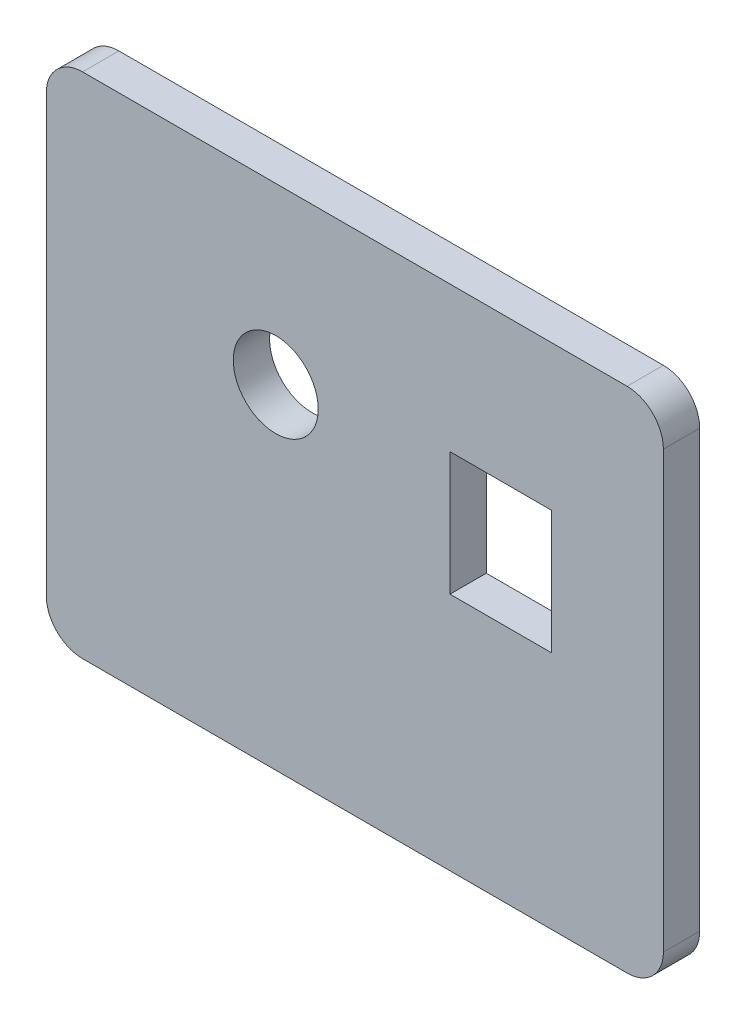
from build123d import *

# Parameters (mm, degrees)
BOSS_EXTRUDE1_DEPTH = 5
SKETCH2_R           = 5.85
SKETCH2_W           = 14
SKETCH2_H           = 17
CUT_EXTRUDE1_DEPTH  = 10


with BuildPart() as part:
    # Sketch1 → Boss-Extrude1 (new body)
    with BuildSketch(Plane.XY):
        with BuildLine():
            Line((-37.5, 35), (37.5, 35))
            ThreePointArc((37.5, 35), (41.035533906, 33.535533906), (42.5, 30))
            Line((42.5, 30), (42.5, -30))
            ThreePointArc((42.5, -30), (41.035533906, -33.535533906), (37.5, -35))
            Line((37.5, -35), (-37.5, -35))
            ThreePointArc((-37.5, -35), (-41.035533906, -33.535533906), (-42.5, -30))
            Line((-42.5, -30), (-42.5, 30))
            ThreePointArc((-42.5, 30), (-41.035533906, 33.535533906), (-37.5, 35))
        make_face()
    extrude(amount=BOSS_EXTRUDE1_DEPTH)

    # Sketch2 → Cut-Extrude1 (cut)
    with BuildSketch(Plane.XY.offset(5)):
        with Locations((-10.895119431, 11)):
            Circle(SKETCH2_R)
        with Locations((20.104880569, 6.5)):
            Rectangle(SKETCH2_W, SKETCH2_H)
    extrude(amount=-CUT_EXTRUDE1_DEPTH, mode=Mode.SUBTRACT)


solid = part.part
